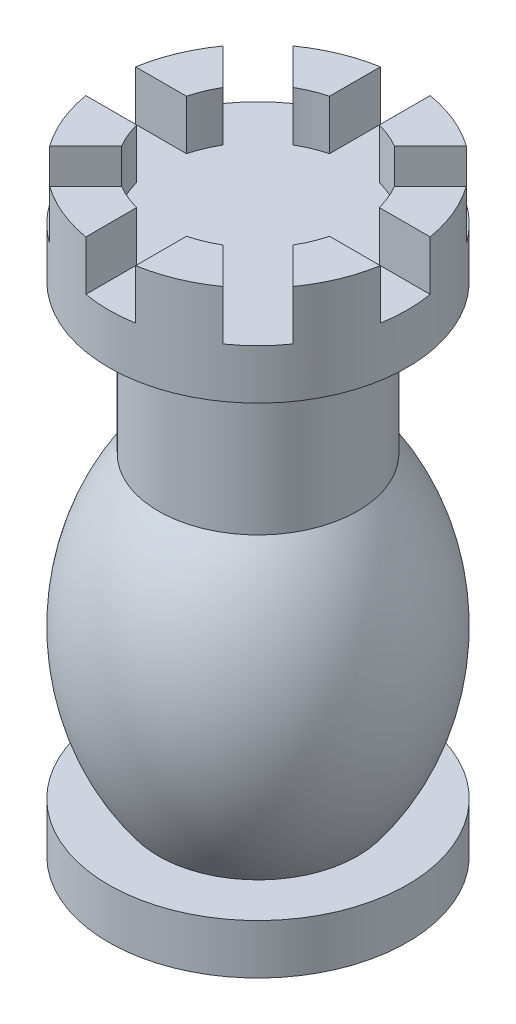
from build123d import *

# Parameters (mm, degrees)
ESQUISSE2_W                  = 4.695400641
ESQUISSE2_H                  = 2
ENL_V_MAT_EXTRU_1_DEPTH      = 2
R_P_TITION_CIRCULAIRE1_COUNT = 8


with BuildPart() as part:
    # Esquisse1 → R_volution1 (revolve)
    with BuildSketch(Plane.XY):
        with BuildLine():
            Line((0, 22), (0, 0))
            Line((0, 0), (-6, 0))
            Line((-6, 0), (-6, 2))
            Line((-6, 2), (-4, 2))
            ThreePointArc((-4, 2), (-6, 8), (-4, 14))
            Line((-4, 14), (-4, 20))
            Line((-4, 20), (-6, 20))
            Line((-6, 20), (-6, 24))
            Line((-6, 24), (-4, 24))
            Line((-4, 24), (-4, 22))
            Line((-4, 22), (0, 22))
        make_face()
    revolve(axis=Axis((0, 34.321643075, 0), (0, -1, 0)))

    # Esquisse2 → Enl_v. mat.-Extru.1 (cut)
    with BuildSketch(Plane(origin=(0, 24, 0), x_dir=(1, 0, 0), z_dir=(0, 1, 0))):
        with Locations((-4.676186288, 0)):
            Rectangle(ESQUISSE2_W, ESQUISSE2_H)
    enl_v_mat_extru_1 = extrude(amount=-ENL_V_MAT_EXTRU_1_DEPTH, mode=Mode.SUBTRACT)

    # R_p_tition circulaire1: Enl_v. mat.-Extru.1 ×8 about axis
    r_p_tition_circulaire1_axis = Axis((0, 0, 0), (0, 1, 0))
    for i in range(1, R_P_TITION_CIRCULAIRE1_COUNT):
        add(enl_v_mat_extru_1.rotate(r_p_tition_circulaire1_axis, i * 360 / R_P_TITION_CIRCULAIRE1_COUNT), mode=Mode.SUBTRACT)


solid = part.part
